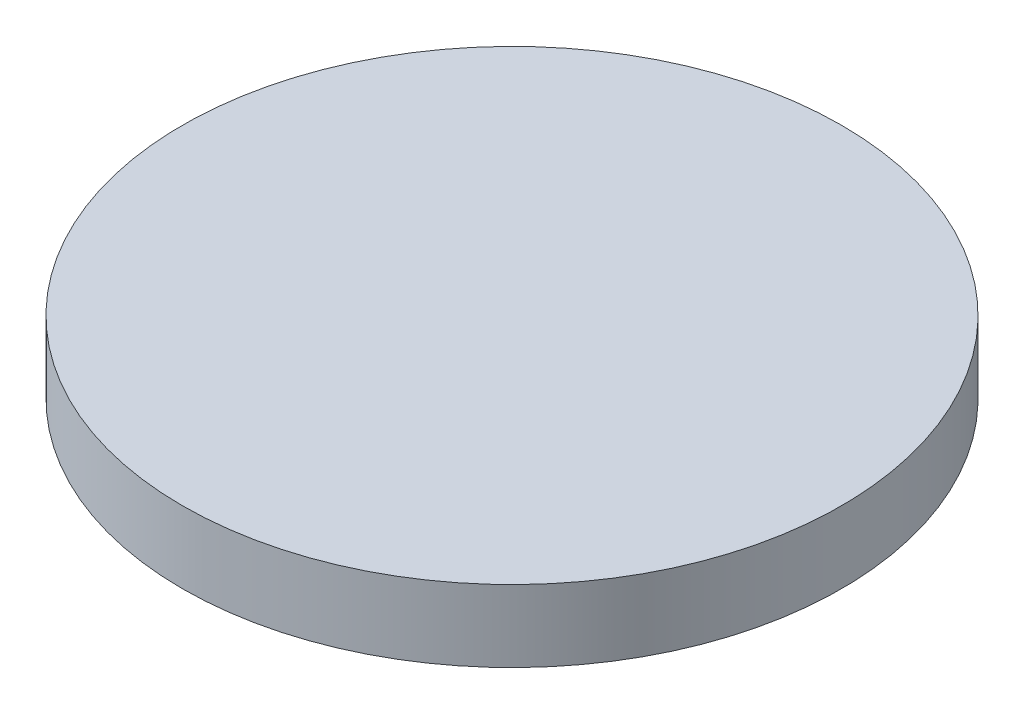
ISO-10303-21;
HEADER;
FILE_DESCRIPTION(('STEP AP214'),'2;1');
FILE_NAME('part.step','',(''),(''),'','','');
FILE_SCHEMA(('AUTOMOTIVE_DESIGN { 1 0 10303 214 1 1 1 1 }'));
ENDSEC;
DATA;
#1=APPLICATION_CONTEXT('core data for automotive mechanical design processes');
#2=APPLICATION_PROTOCOL_DEFINITION('international standard','automotive_design',2000,#1);
#3=PRODUCT_CONTEXT('',#1,'mechanical');
#4=PRODUCT('Part','Part','',(#3));
#5=PRODUCT_RELATED_PRODUCT_CATEGORY('part','',(#4));
#6=PRODUCT_DEFINITION_FORMATION('','',#4);
#7=PRODUCT_DEFINITION_CONTEXT('part definition',#1,'design');
#8=PRODUCT_DEFINITION('design','',#6,#7);
#9=PRODUCT_DEFINITION_SHAPE('','',#8);
#10=(LENGTH_UNIT() NAMED_UNIT(*) SI_UNIT(.MILLI.,.METRE.));
#11=(NAMED_UNIT(*) PLANE_ANGLE_UNIT() SI_UNIT($,.RADIAN.));
#12=(NAMED_UNIT(*) SI_UNIT($,.STERADIAN.) SOLID_ANGLE_UNIT());
#13=UNCERTAINTY_MEASURE_WITH_UNIT(LENGTH_MEASURE(1.E-05),#10,'distance_accuracy_value','');
#14=(GEOMETRIC_REPRESENTATION_CONTEXT(3) GLOBAL_UNCERTAINTY_ASSIGNED_CONTEXT((#13)) GLOBAL_UNIT_ASSIGNED_CONTEXT((#10,
#11,#12)) REPRESENTATION_CONTEXT('',''));
#15=CARTESIAN_POINT('',(0.,0.,0.));
#16=DIRECTION('',(0.,0.,1.));
#17=DIRECTION('',(1.,0.,0.));
#18=AXIS2_PLACEMENT_3D('',#15,#16,#17);
#19=CARTESIAN_POINT('',(0.,0.,0.));
#20=DIRECTION('',(0.,1.,0.));
#21=DIRECTION('',(0.,0.,1.));
#22=AXIS2_PLACEMENT_3D('',#19,#20,#21);
#23=PLANE('',#22);
#24=CARTESIAN_POINT('',(5.46099999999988,0.,9.45872946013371));
#25=DIRECTION('',(0.,-1.,0.));
#26=DIRECTION('',(-0.499999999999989,0.,-0.866025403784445));
#27=AXIS2_PLACEMENT_3D('',#24,#25,#26);
#28=CIRCLE('',#27,1.5875);
#29=CARTESIAN_POINT('',(4.6672499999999,0.,8.0839141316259));
#30=VERTEX_POINT('',#29);
#31=EDGE_CURVE('E120',#30,#30,#28,.T.);
#32=ORIENTED_EDGE('',*,*,#31,.F.);
#33=EDGE_LOOP('',(#32));
#34=FACE_BOUND('',#33,.T.);
#35=CARTESIAN_POINT('',(9.45872946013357,0.,5.46100000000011));
#36=DIRECTION('',(0.,-1.,0.));
#37=DIRECTION('',(-0.866025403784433,0.,-0.50000000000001));
#38=AXIS2_PLACEMENT_3D('',#35,#36,#37);
#39=CIRCLE('',#38,1.5875);
#40=CARTESIAN_POINT('',(8.08391413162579,0.,4.66725000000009));
#41=VERTEX_POINT('',#40);
#42=EDGE_CURVE('E114',#41,#41,#39,.T.);
#43=ORIENTED_EDGE('',*,*,#42,.F.);
#44=EDGE_LOOP('',(#43));
#45=FACE_BOUND('',#44,.T.);
#46=CARTESIAN_POINT('',(10.922,0.,1.14401877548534E-13));
#47=DIRECTION('',(0.,-1.,0.));
#48=DIRECTION('',(-1.,0.,0.));
#49=AXIS2_PLACEMENT_3D('',#46,#47,#48);
#50=CIRCLE('',#49,1.5875);
#51=CARTESIAN_POINT('',(9.3345,0.,0.));
#52=VERTEX_POINT('',#51);
#53=EDGE_CURVE('E108',#52,#52,#50,.T.);
#54=ORIENTED_EDGE('',*,*,#53,.F.);
#55=EDGE_LOOP('',(#54));
#56=FACE_BOUND('',#55,.T.);
#57=CARTESIAN_POINT('',(9.45872946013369,0.,-5.46099999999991));
#58=DIRECTION('',(0.,-1.,0.));
#59=DIRECTION('',(-0.866025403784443,0.,0.499999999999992));
#60=AXIS2_PLACEMENT_3D('',#57,#58,#59);
#61=CIRCLE('',#60,1.5875);
#62=CARTESIAN_POINT('',(8.08391413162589,0.,-4.66724999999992));
#63=VERTEX_POINT('',#62);
#64=EDGE_CURVE('E102',#63,#63,#61,.T.);
#65=ORIENTED_EDGE('',*,*,#64,.F.);
#66=EDGE_LOOP('',(#65));
#67=FACE_BOUND('',#66,.T.);
#68=CARTESIAN_POINT('',(5.46100000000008,0.,-9.45872946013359));
#69=DIRECTION('',(0.,-1.,0.));
#70=DIRECTION('',(-0.500000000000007,0.,0.866025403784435));
#71=AXIS2_PLACEMENT_3D('',#68,#69,#70);
#72=CIRCLE('',#71,1.5875);
#73=CARTESIAN_POINT('',(4.66725000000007,0.,-8.0839141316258));
#74=VERTEX_POINT('',#73);
#75=EDGE_CURVE('E96',#74,#74,#72,.T.);
#76=ORIENTED_EDGE('',*,*,#75,.F.);
#77=EDGE_LOOP('',(#76));
#78=FACE_BOUND('',#77,.T.);
#79=CARTESIAN_POINT('',(0.,0.,-10.922));
#80=DIRECTION('',(0.,-1.,0.));
#81=DIRECTION('',(0.,0.,1.));
#82=AXIS2_PLACEMENT_3D('',#79,#80,#81);
#83=CIRCLE('',#82,1.5875);
#84=CARTESIAN_POINT('',(0.,0.,-9.3345));
#85=VERTEX_POINT('',#84);
#86=EDGE_CURVE('E90',#85,#85,#83,.T.);
#87=ORIENTED_EDGE('',*,*,#86,.F.);
#88=EDGE_LOOP('',(#87));
#89=FACE_BOUND('',#88,.T.);
#90=CARTESIAN_POINT('',(-5.46099999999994,0.,-9.45872946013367));
#91=DIRECTION('',(0.,-1.,0.));
#92=DIRECTION('',(0.499999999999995,0.,0.866025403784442));
#93=AXIS2_PLACEMENT_3D('',#90,#91,#92);
#94=CIRCLE('',#93,1.5875);
#95=CARTESIAN_POINT('',(-4.66724999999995,0.,-8.08391413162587));
#96=VERTEX_POINT('',#95);
#97=EDGE_CURVE('E84',#96,#96,#94,.T.);
#98=ORIENTED_EDGE('',*,*,#97,.F.);
#99=EDGE_LOOP('',(#98));
#100=FACE_BOUND('',#99,.T.);
#101=CARTESIAN_POINT('',(-9.45872946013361,0.,-5.46100000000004));
#102=DIRECTION('',(0.,-1.,0.));
#103=DIRECTION('',(0.866025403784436,0.,0.500000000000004));
#104=AXIS2_PLACEMENT_3D('',#101,#102,#103);
#105=CIRCLE('',#104,1.5875);
#106=CARTESIAN_POINT('',(-8.08391413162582,0.,-4.66725000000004));
#107=VERTEX_POINT('',#106);
#108=EDGE_CURVE('E78',#107,#107,#105,.T.);
#109=ORIENTED_EDGE('',*,*,#108,.F.);
#110=EDGE_LOOP('',(#109));
#111=FACE_BOUND('',#110,.T.);
#112=CARTESIAN_POINT('',(-10.922,0.,0.));
#113=DIRECTION('',(0.,-1.,0.));
#114=DIRECTION('',(1.,0.,0.));
#115=AXIS2_PLACEMENT_3D('',#112,#113,#114);
#116=CIRCLE('',#115,1.5875);
#117=CARTESIAN_POINT('',(-9.3345,0.,0.));
#118=VERTEX_POINT('',#117);
#119=EDGE_CURVE('E72',#118,#118,#116,.T.);
#120=ORIENTED_EDGE('',*,*,#119,.F.);
#121=EDGE_LOOP('',(#120));
#122=FACE_BOUND('',#121,.T.);
#123=CARTESIAN_POINT('',(-9.45872946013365,0.,5.46099999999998));
#124=DIRECTION('',(0.,-1.,0.));
#125=DIRECTION('',(0.86602540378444,0.,-0.499999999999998));
#126=AXIS2_PLACEMENT_3D('',#123,#124,#125);
#127=CIRCLE('',#126,1.5875);
#128=CARTESIAN_POINT('',(-8.08391413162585,0.,4.66724999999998));
#129=VERTEX_POINT('',#128);
#130=EDGE_CURVE('E66',#129,#129,#127,.T.);
#131=ORIENTED_EDGE('',*,*,#130,.F.);
#132=EDGE_LOOP('',(#131));
#133=FACE_BOUND('',#132,.T.);
#134=CARTESIAN_POINT('',(-5.46100000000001,0.,9.45872946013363));
#135=DIRECTION('',(0.,-1.,0.));
#136=DIRECTION('',(0.500000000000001,0.,-0.866025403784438));
#137=AXIS2_PLACEMENT_3D('',#134,#135,#136);
#138=CIRCLE('',#137,1.5875);
#139=CARTESIAN_POINT('',(-4.66725000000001,0.,8.08391413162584));
#140=VERTEX_POINT('',#139);
#141=EDGE_CURVE('E60',#140,#140,#138,.T.);
#142=ORIENTED_EDGE('',*,*,#141,.F.);
#143=EDGE_LOOP('',(#142));
#144=FACE_BOUND('',#143,.T.);
#145=CARTESIAN_POINT('',(0.,0.,10.922));
#146=DIRECTION('',(0.,-1.,0.));
#147=DIRECTION('',(0.,0.,-1.));
#148=AXIS2_PLACEMENT_3D('',#145,#146,#147);
#149=CIRCLE('',#148,1.5875);
#150=CARTESIAN_POINT('',(0.,0.,9.3345));
#151=VERTEX_POINT('',#150);
#152=EDGE_CURVE('E54',#151,#151,#149,.T.);
#153=ORIENTED_EDGE('',*,*,#152,.F.);
#154=EDGE_LOOP('',(#153));
#155=FACE_BOUND('',#154,.T.);
#156=CARTESIAN_POINT('',(0.,0.,0.));
#157=DIRECTION('',(0.,1.,0.));
#158=DIRECTION('',(0.,0.,1.));
#159=AXIS2_PLACEMENT_3D('',#156,#157,#158);
#160=CIRCLE('',#159,13.97);
#161=CARTESIAN_POINT('',(0.,0.,-13.97));
#162=VERTEX_POINT('',#161);
#163=EDGE_CURVE('E44',#162,#162,#160,.T.);
#164=ORIENTED_EDGE('',*,*,#163,.F.);
#165=EDGE_LOOP('',(#164));
#166=FACE_BOUND('',#165,.T.);
#167=CARTESIAN_POINT('',(0.,0.,0.));
#168=DIRECTION('',(0.,1.,0.));
#169=DIRECTION('',(0.,0.,1.));
#170=AXIS2_PLACEMENT_3D('',#167,#168,#169);
#171=CIRCLE('',#170,8.001);
#172=CARTESIAN_POINT('',(0.,0.,8.001));
#173=VERTEX_POINT('',#172);
#174=EDGE_CURVE('E10',#173,#173,#171,.F.);
#175=ORIENTED_EDGE('',*,*,#174,.F.);
#176=EDGE_LOOP('',(#175));
#177=FACE_BOUND('',#176,.T.);
#178=ADVANCED_FACE('F33',(#34,#45,#56,#67,#78,#89,#100,#111,#122,#133,#144,#155,#166,#177),#23,.F.);
#179=CARTESIAN_POINT('',(0.,3.048,0.));
#180=DIRECTION('',(0.,-1.,0.));
#181=DIRECTION('',(0.,0.,-1.));
#182=AXIS2_PLACEMENT_3D('',#179,#180,#181);
#183=CYLINDRICAL_SURFACE('',#182,13.97);
#184=CARTESIAN_POINT('',(0.,3.048,0.));
#185=DIRECTION('',(0.,1.,0.));
#186=DIRECTION('',(0.,0.,1.));
#187=AXIS2_PLACEMENT_3D('',#184,#185,#186);
#188=CIRCLE('',#187,13.97);
#189=CARTESIAN_POINT('',(0.,3.048,-13.97));
#190=VERTEX_POINT('',#189);
#191=EDGE_CURVE('E40',#190,#190,#188,.T.);
#192=CARTESIAN_POINT('',(0.,3.048,-13.97));
#193=CARTESIAN_POINT('',(0.,3.01625,-13.97));
#194=CARTESIAN_POINT('',(0.,2.9845,-13.97));
#195=CARTESIAN_POINT('',(0.,2.921,-13.97));
#196=CARTESIAN_POINT('',(0.,2.88925,-13.97));
#197=CARTESIAN_POINT('',(0.,2.82575,-13.97));
#198=CARTESIAN_POINT('',(0.,2.794,-13.97));
#199=CARTESIAN_POINT('',(0.,2.7305,-13.97));
#200=CARTESIAN_POINT('',(0.,2.69875,-13.97));
#201=CARTESIAN_POINT('',(0.,2.63525,-13.97));
#202=CARTESIAN_POINT('',(0.,2.6035,-13.97));
#203=CARTESIAN_POINT('',(0.,2.54,-13.97));
#204=CARTESIAN_POINT('',(0.,2.50825,-13.97));
#205=CARTESIAN_POINT('',(0.,2.44475,-13.97));
#206=CARTESIAN_POINT('',(0.,2.413,-13.97));
#207=CARTESIAN_POINT('',(0.,2.3495,-13.97));
#208=CARTESIAN_POINT('',(0.,2.31775,-13.97));
#209=CARTESIAN_POINT('',(0.,2.25425,-13.97));
#210=CARTESIAN_POINT('',(0.,2.2225,-13.97));
#211=CARTESIAN_POINT('',(0.,2.159,-13.97));
#212=CARTESIAN_POINT('',(0.,2.12725,-13.97));
#213=CARTESIAN_POINT('',(0.,2.06375,-13.97));
#214=CARTESIAN_POINT('',(0.,2.032,-13.97));
#215=CARTESIAN_POINT('',(0.,1.9685,-13.97));
#216=CARTESIAN_POINT('',(0.,1.93675,-13.97));
#217=CARTESIAN_POINT('',(0.,1.87325,-13.97));
#218=CARTESIAN_POINT('',(0.,1.8415,-13.97));
#219=CARTESIAN_POINT('',(0.,1.778,-13.97));
#220=CARTESIAN_POINT('',(0.,1.74625,-13.97));
#221=CARTESIAN_POINT('',(0.,1.68275,-13.97));
#222=CARTESIAN_POINT('',(0.,1.651,-13.97));
#223=CARTESIAN_POINT('',(0.,1.5875,-13.97));
#224=CARTESIAN_POINT('',(0.,1.55575,-13.97));
#225=CARTESIAN_POINT('',(0.,1.49225,-13.97));
#226=CARTESIAN_POINT('',(0.,1.4605,-13.97));
#227=CARTESIAN_POINT('',(0.,1.397,-13.97));
#228=CARTESIAN_POINT('',(0.,1.36525,-13.97));
#229=CARTESIAN_POINT('',(0.,1.30175,-13.97));
#230=CARTESIAN_POINT('',(0.,1.27,-13.97));
#231=CARTESIAN_POINT('',(0.,1.2065,-13.97));
#232=CARTESIAN_POINT('',(0.,1.17475,-13.97));
#233=CARTESIAN_POINT('',(0.,1.11125,-13.97));
#234=CARTESIAN_POINT('',(0.,1.0795,-13.97));
#235=CARTESIAN_POINT('',(0.,1.016,-13.97));
#236=CARTESIAN_POINT('',(0.,0.98425,-13.97));
#237=CARTESIAN_POINT('',(0.,0.92075,-13.97));
#238=CARTESIAN_POINT('',(0.,0.889,-13.97));
#239=CARTESIAN_POINT('',(0.,0.8255,-13.97));
#240=CARTESIAN_POINT('',(0.,0.79375,-13.97));
#241=CARTESIAN_POINT('',(0.,0.73025,-13.97));
#242=CARTESIAN_POINT('',(0.,0.6985,-13.97));
#243=CARTESIAN_POINT('',(0.,0.635,-13.97));
#244=CARTESIAN_POINT('',(0.,0.60325,-13.97));
#245=CARTESIAN_POINT('',(0.,0.53975,-13.97));
#246=CARTESIAN_POINT('',(0.,0.508,-13.97));
#247=CARTESIAN_POINT('',(0.,0.4445,-13.97));
#248=CARTESIAN_POINT('',(0.,0.41275,-13.97));
#249=CARTESIAN_POINT('',(0.,0.34925,-13.97));
#250=CARTESIAN_POINT('',(0.,0.3175,-13.97));
#251=CARTESIAN_POINT('',(0.,0.254,-13.97));
#252=CARTESIAN_POINT('',(0.,0.22225,-13.97));
#253=CARTESIAN_POINT('',(0.,0.15875,-13.97));
#254=CARTESIAN_POINT('',(0.,0.127,-13.97));
#255=CARTESIAN_POINT('',(0.,0.0634999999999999,-13.97));
#256=CARTESIAN_POINT('',(0.,0.03175,-13.97));
#257=CARTESIAN_POINT('',(0.,0.,-13.97));
#258=B_SPLINE_CURVE_WITH_KNOTS('',3,(#192,#193,#194,#195,#196,#197,#198,#199,#200,#201,#202,
#203,#204,#205,#206,#207,#208,#209,#210,#211,#212,#213,#214,#215,#216,#217,#218,#219,#220,#221,
#222,#223,#224,#225,#226,#227,#228,#229,#230,#231,#232,#233,#234,#235,#236,#237,#238,#239,#240,
#241,#242,#243,#244,#245,#246,#247,#248,#249,#250,#251,#252,#253,#254,#255,#256,#257),
.UNSPECIFIED.,.F.,.F.,(4,2,2,2,2,2,2,2,2,2,2,2,2,2,2,2,2,2,2,2,2,2,2,2,2,2,2,2,2,2,2,2,4),(0.,
0.0952500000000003,0.1905,0.28575,0.381,0.47625,0.5715,0.66675,0.762,0.85725,0.9525,1.04775,
1.143,1.23825,1.3335,1.42875,1.524,1.61925,1.7145,1.80975,1.905,2.00025,2.0955,2.19075,2.286,
2.38125,2.4765,2.57175,2.667,2.76225,2.8575,2.95275,3.048),.UNSPECIFIED.);
#259=EDGE_CURVE('BSEAM35',#190,#162,#258,.T.);
#260=ORIENTED_EDGE('',*,*,#191,.F.);
#261=ORIENTED_EDGE('',*,*,#163,.T.);
#262=ORIENTED_EDGE('',*,*,#259,.T.);
#263=ORIENTED_EDGE('',*,*,#259,.F.);
#264=EDGE_LOOP('',(#260,#262,#261,#263));
#265=FACE_BOUND('',#264,.T.);
#266=ADVANCED_FACE('F35',(#265),#183,.T.);
#267=CARTESIAN_POINT('',(0.,3.048,0.));
#268=DIRECTION('',(0.,1.,0.));
#269=DIRECTION('',(0.,0.,1.));
#270=AXIS2_PLACEMENT_3D('',#267,#268,#269);
#271=PLANE('',#270);
#272=ORIENTED_EDGE('',*,*,#191,.T.);
#273=EDGE_LOOP('',(#272));
#274=FACE_BOUND('',#273,.T.);
#275=ADVANCED_FACE('F163',(#274),#271,.T.);
#276=CARTESIAN_POINT('',(0.,-1.778,0.));
#277=DIRECTION('',(0.,1.,0.));
#278=DIRECTION('',(0.,0.,1.));
#279=AXIS2_PLACEMENT_3D('',#276,#277,#278);
#280=CYLINDRICAL_SURFACE('',#279,8.001);
#281=CARTESIAN_POINT('',(0.,-1.778,0.));
#282=DIRECTION('',(0.,-1.,0.));
#283=DIRECTION('',(0.,0.,-1.));
#284=AXIS2_PLACEMENT_3D('',#281,#282,#283);
#285=CIRCLE('',#284,8.001);
#286=CARTESIAN_POINT('',(0.,-1.778,-8.001));
#287=VERTEX_POINT('',#286);
#288=EDGE_CURVE('E49',#287,#287,#285,.T.);
#289=ORIENTED_EDGE('',*,*,#288,.F.);
#290=EDGE_LOOP('',(#289));
#291=FACE_BOUND('',#290,.T.);
#292=ORIENTED_EDGE('',*,*,#174,.T.);
#293=EDGE_LOOP('',(#292));
#294=FACE_BOUND('',#293,.T.);
#295=ADVANCED_FACE('F168',(#291,#294),#280,.T.);
#296=CARTESIAN_POINT('',(0.,-1.778,0.));
#297=DIRECTION('',(0.,-1.,0.));
#298=DIRECTION('',(0.,0.,-1.));
#299=AXIS2_PLACEMENT_3D('',#296,#297,#298);
#300=PLANE('',#299);
#301=ORIENTED_EDGE('',*,*,#288,.T.);
#302=EDGE_LOOP('',(#301));
#303=FACE_BOUND('',#302,.T.);
#304=ADVANCED_FACE('F173',(#303),#300,.T.);
#305=CARTESIAN_POINT('',(0.,0.508,10.922));
#306=DIRECTION('',(0.,-1.,0.));
#307=DIRECTION('',(0.,0.,-1.));
#308=AXIS2_PLACEMENT_3D('',#305,#306,#307);
#309=CYLINDRICAL_SURFACE('',#308,1.5875);
#310=CARTESIAN_POINT('',(0.,0.508,10.922));
#311=DIRECTION('',(0.,-1.,0.));
#312=DIRECTION('',(0.,0.,-1.));
#313=AXIS2_PLACEMENT_3D('',#310,#311,#312);
#314=CIRCLE('',#313,1.5875);
#315=CARTESIAN_POINT('',(0.,0.508,9.3345));
#316=VERTEX_POINT('',#315);
#317=EDGE_CURVE('E53',#316,#316,#314,.T.);
#318=ORIENTED_EDGE('',*,*,#317,.F.);
#319=EDGE_LOOP('',(#318));
#320=FACE_BOUND('',#319,.T.);
#321=ORIENTED_EDGE('',*,*,#152,.T.);
#322=EDGE_LOOP('',(#321));
#323=FACE_BOUND('',#322,.T.);
#324=ADVANCED_FACE('F179',(#320,#323),#309,.F.);
#325=CARTESIAN_POINT('',(0.,0.508,10.922));
#326=DIRECTION('',(0.,-1.,0.));
#327=DIRECTION('',(0.,0.,-1.));
#328=AXIS2_PLACEMENT_3D('',#325,#326,#327);
#329=PLANE('',#328);
#330=ORIENTED_EDGE('',*,*,#317,.T.);
#331=EDGE_LOOP('',(#330));
#332=FACE_BOUND('',#331,.T.);
#333=ADVANCED_FACE('F183',(#332),#329,.T.);
#334=CARTESIAN_POINT('',(-5.46100000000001,0.508,9.45872946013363));
#335=DIRECTION('',(0.,-1.,0.));
#336=DIRECTION('',(0.,0.,-1.));
#337=AXIS2_PLACEMENT_3D('',#334,#335,#336);
#338=CYLINDRICAL_SURFACE('',#337,1.5875);
#339=CARTESIAN_POINT('',(-5.46100000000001,0.508,9.45872946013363));
#340=DIRECTION('',(0.,-1.,0.));
#341=DIRECTION('',(0.500000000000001,0.,-0.866025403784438));
#342=AXIS2_PLACEMENT_3D('',#339,#340,#341);
#343=CIRCLE('',#342,1.5875);
#344=CARTESIAN_POINT('',(-4.66725000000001,0.508,8.08391413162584));
#345=VERTEX_POINT('',#344);
#346=EDGE_CURVE('E57',#345,#345,#343,.T.);
#347=ORIENTED_EDGE('',*,*,#346,.F.);
#348=EDGE_LOOP('',(#347));
#349=FACE_BOUND('',#348,.T.);
#350=ORIENTED_EDGE('',*,*,#141,.T.);
#351=EDGE_LOOP('',(#350));
#352=FACE_BOUND('',#351,.T.);
#353=ADVANCED_FACE('F187',(#349,#352),#338,.F.);
#354=CARTESIAN_POINT('',(-5.46100000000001,0.508,9.45872946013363));
#355=DIRECTION('',(0.,-1.,0.));
#356=DIRECTION('',(0.500000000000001,0.,-0.866025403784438));
#357=AXIS2_PLACEMENT_3D('',#354,#355,#356);
#358=PLANE('',#357);
#359=ORIENTED_EDGE('',*,*,#346,.T.);
#360=EDGE_LOOP('',(#359));
#361=FACE_BOUND('',#360,.T.);
#362=ADVANCED_FACE('F191',(#361),#358,.T.);
#363=CARTESIAN_POINT('',(-9.45872946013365,0.508,5.46099999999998));
#364=DIRECTION('',(0.,-1.,0.));
#365=DIRECTION('',(0.,0.,-1.));
#366=AXIS2_PLACEMENT_3D('',#363,#364,#365);
#367=CYLINDRICAL_SURFACE('',#366,1.5875);
#368=CARTESIAN_POINT('',(-9.45872946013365,0.508,5.46099999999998));
#369=DIRECTION('',(0.,-1.,0.));
#370=DIRECTION('',(0.86602540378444,0.,-0.499999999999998));
#371=AXIS2_PLACEMENT_3D('',#368,#369,#370);
#372=CIRCLE('',#371,1.5875);
#373=CARTESIAN_POINT('',(-8.08391413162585,0.508,4.66724999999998));
#374=VERTEX_POINT('',#373);
#375=EDGE_CURVE('E63',#374,#374,#372,.T.);
#376=ORIENTED_EDGE('',*,*,#375,.F.);
#377=EDGE_LOOP('',(#376));
#378=FACE_BOUND('',#377,.T.);
#379=ORIENTED_EDGE('',*,*,#130,.T.);
#380=EDGE_LOOP('',(#379));
#381=FACE_BOUND('',#380,.T.);
#382=ADVANCED_FACE('F195',(#378,#381),#367,.F.);
#383=CARTESIAN_POINT('',(-9.45872946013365,0.508,5.46099999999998));
#384=DIRECTION('',(0.,-1.,0.));
#385=DIRECTION('',(0.86602540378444,0.,-0.499999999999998));
#386=AXIS2_PLACEMENT_3D('',#383,#384,#385);
#387=PLANE('',#386);
#388=ORIENTED_EDGE('',*,*,#375,.T.);
#389=EDGE_LOOP('',(#388));
#390=FACE_BOUND('',#389,.T.);
#391=ADVANCED_FACE('F199',(#390),#387,.T.);
#392=CARTESIAN_POINT('',(-10.922,0.508,0.));
#393=DIRECTION('',(0.,-1.,0.));
#394=DIRECTION('',(0.,0.,-1.));
#395=AXIS2_PLACEMENT_3D('',#392,#393,#394);
#396=CYLINDRICAL_SURFACE('',#395,1.5875);
#397=CARTESIAN_POINT('',(-10.922,0.508,0.));
#398=DIRECTION('',(0.,-1.,0.));
#399=DIRECTION('',(1.,0.,0.));
#400=AXIS2_PLACEMENT_3D('',#397,#398,#399);
#401=CIRCLE('',#400,1.5875);
#402=CARTESIAN_POINT('',(-9.3345,0.508,0.));
#403=VERTEX_POINT('',#402);
#404=EDGE_CURVE('E69',#403,#403,#401,.T.);
#405=ORIENTED_EDGE('',*,*,#404,.F.);
#406=EDGE_LOOP('',(#405));
#407=FACE_BOUND('',#406,.T.);
#408=ORIENTED_EDGE('',*,*,#119,.T.);
#409=EDGE_LOOP('',(#408));
#410=FACE_BOUND('',#409,.T.);
#411=ADVANCED_FACE('F203',(#407,#410),#396,.F.);
#412=CARTESIAN_POINT('',(-10.922,0.508,0.));
#413=DIRECTION('',(0.,-1.,0.));
#414=DIRECTION('',(1.,0.,0.));
#415=AXIS2_PLACEMENT_3D('',#412,#413,#414);
#416=PLANE('',#415);
#417=ORIENTED_EDGE('',*,*,#404,.T.);
#418=EDGE_LOOP('',(#417));
#419=FACE_BOUND('',#418,.T.);
#420=ADVANCED_FACE('F207',(#419),#416,.T.);
#421=CARTESIAN_POINT('',(-9.45872946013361,0.508,-5.46100000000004));
#422=DIRECTION('',(0.,-1.,0.));
#423=DIRECTION('',(0.,0.,-1.));
#424=AXIS2_PLACEMENT_3D('',#421,#422,#423);
#425=CYLINDRICAL_SURFACE('',#424,1.5875);
#426=CARTESIAN_POINT('',(-9.45872946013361,0.508,-5.46100000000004));
#427=DIRECTION('',(0.,-1.,0.));
#428=DIRECTION('',(0.866025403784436,0.,0.500000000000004));
#429=AXIS2_PLACEMENT_3D('',#426,#427,#428);
#430=CIRCLE('',#429,1.5875);
#431=CARTESIAN_POINT('',(-8.08391413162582,0.508,-4.66725000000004));
#432=VERTEX_POINT('',#431);
#433=EDGE_CURVE('E75',#432,#432,#430,.T.);
#434=ORIENTED_EDGE('',*,*,#433,.F.);
#435=EDGE_LOOP('',(#434));
#436=FACE_BOUND('',#435,.T.);
#437=ORIENTED_EDGE('',*,*,#108,.T.);
#438=EDGE_LOOP('',(#437));
#439=FACE_BOUND('',#438,.T.);
#440=ADVANCED_FACE('F211',(#436,#439),#425,.F.);
#441=CARTESIAN_POINT('',(-9.45872946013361,0.508,-5.46100000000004));
#442=DIRECTION('',(0.,-1.,0.));
#443=DIRECTION('',(0.866025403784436,0.,0.500000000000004));
#444=AXIS2_PLACEMENT_3D('',#441,#442,#443);
#445=PLANE('',#444);
#446=ORIENTED_EDGE('',*,*,#433,.T.);
#447=EDGE_LOOP('',(#446));
#448=FACE_BOUND('',#447,.T.);
#449=ADVANCED_FACE('F215',(#448),#445,.T.);
#450=CARTESIAN_POINT('',(-5.46099999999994,0.508,-9.45872946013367));
#451=DIRECTION('',(0.,-1.,0.));
#452=DIRECTION('',(0.,0.,-1.));
#453=AXIS2_PLACEMENT_3D('',#450,#451,#452);
#454=CYLINDRICAL_SURFACE('',#453,1.5875);
#455=CARTESIAN_POINT('',(-5.46099999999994,0.508,-9.45872946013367));
#456=DIRECTION('',(0.,-1.,0.));
#457=DIRECTION('',(0.499999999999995,0.,0.866025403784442));
#458=AXIS2_PLACEMENT_3D('',#455,#456,#457);
#459=CIRCLE('',#458,1.5875);
#460=CARTESIAN_POINT('',(-4.66724999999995,0.508,-8.08391413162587));
#461=VERTEX_POINT('',#460);
#462=EDGE_CURVE('E81',#461,#461,#459,.T.);
#463=ORIENTED_EDGE('',*,*,#462,.F.);
#464=EDGE_LOOP('',(#463));
#465=FACE_BOUND('',#464,.T.);
#466=ORIENTED_EDGE('',*,*,#97,.T.);
#467=EDGE_LOOP('',(#466));
#468=FACE_BOUND('',#467,.T.);
#469=ADVANCED_FACE('F219',(#465,#468),#454,.F.);
#470=CARTESIAN_POINT('',(-5.46099999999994,0.508,-9.45872946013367));
#471=DIRECTION('',(0.,-1.,0.));
#472=DIRECTION('',(0.499999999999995,0.,0.866025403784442));
#473=AXIS2_PLACEMENT_3D('',#470,#471,#472);
#474=PLANE('',#473);
#475=ORIENTED_EDGE('',*,*,#462,.T.);
#476=EDGE_LOOP('',(#475));
#477=FACE_BOUND('',#476,.T.);
#478=ADVANCED_FACE('F223',(#477),#474,.T.);
#479=CARTESIAN_POINT('',(0.,0.508,-10.922));
#480=DIRECTION('',(0.,-1.,0.));
#481=DIRECTION('',(0.,0.,-1.));
#482=AXIS2_PLACEMENT_3D('',#479,#480,#481);
#483=CYLINDRICAL_SURFACE('',#482,1.5875);
#484=CARTESIAN_POINT('',(0.,0.508,-10.922));
#485=DIRECTION('',(0.,-1.,0.));
#486=DIRECTION('',(0.,0.,1.));
#487=AXIS2_PLACEMENT_3D('',#484,#485,#486);
#488=CIRCLE('',#487,1.5875);
#489=CARTESIAN_POINT('',(0.,0.508,-9.3345));
#490=VERTEX_POINT('',#489);
#491=EDGE_CURVE('E87',#490,#490,#488,.T.);
#492=ORIENTED_EDGE('',*,*,#491,.F.);
#493=EDGE_LOOP('',(#492));
#494=FACE_BOUND('',#493,.T.);
#495=ORIENTED_EDGE('',*,*,#86,.T.);
#496=EDGE_LOOP('',(#495));
#497=FACE_BOUND('',#496,.T.);
#498=ADVANCED_FACE('F227',(#494,#497),#483,.F.);
#499=CARTESIAN_POINT('',(0.,0.508,-10.922));
#500=DIRECTION('',(0.,-1.,0.));
#501=DIRECTION('',(0.,0.,1.));
#502=AXIS2_PLACEMENT_3D('',#499,#500,#501);
#503=PLANE('',#502);
#504=ORIENTED_EDGE('',*,*,#491,.T.);
#505=EDGE_LOOP('',(#504));
#506=FACE_BOUND('',#505,.T.);
#507=ADVANCED_FACE('F231',(#506),#503,.T.);
#508=CARTESIAN_POINT('',(5.46100000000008,0.508,-9.45872946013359));
#509=DIRECTION('',(0.,-1.,0.));
#510=DIRECTION('',(0.,0.,-1.));
#511=AXIS2_PLACEMENT_3D('',#508,#509,#510);
#512=CYLINDRICAL_SURFACE('',#511,1.5875);
#513=CARTESIAN_POINT('',(5.46100000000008,0.508,-9.45872946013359));
#514=DIRECTION('',(0.,-1.,0.));
#515=DIRECTION('',(-0.500000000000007,0.,0.866025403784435));
#516=AXIS2_PLACEMENT_3D('',#513,#514,#515);
#517=CIRCLE('',#516,1.5875);
#518=CARTESIAN_POINT('',(4.66725000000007,0.508,-8.0839141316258));
#519=VERTEX_POINT('',#518);
#520=EDGE_CURVE('E93',#519,#519,#517,.T.);
#521=ORIENTED_EDGE('',*,*,#520,.F.);
#522=EDGE_LOOP('',(#521));
#523=FACE_BOUND('',#522,.T.);
#524=ORIENTED_EDGE('',*,*,#75,.T.);
#525=EDGE_LOOP('',(#524));
#526=FACE_BOUND('',#525,.T.);
#527=ADVANCED_FACE('F235',(#523,#526),#512,.F.);
#528=CARTESIAN_POINT('',(5.46100000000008,0.508,-9.45872946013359));
#529=DIRECTION('',(0.,-1.,0.));
#530=DIRECTION('',(-0.500000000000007,0.,0.866025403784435));
#531=AXIS2_PLACEMENT_3D('',#528,#529,#530);
#532=PLANE('',#531);
#533=ORIENTED_EDGE('',*,*,#520,.T.);
#534=EDGE_LOOP('',(#533));
#535=FACE_BOUND('',#534,.T.);
#536=ADVANCED_FACE('F239',(#535),#532,.T.);
#537=CARTESIAN_POINT('',(9.45872946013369,0.508,-5.46099999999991));
#538=DIRECTION('',(0.,-1.,0.));
#539=DIRECTION('',(0.,0.,-1.));
#540=AXIS2_PLACEMENT_3D('',#537,#538,#539);
#541=CYLINDRICAL_SURFACE('',#540,1.5875);
#542=CARTESIAN_POINT('',(9.45872946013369,0.508,-5.46099999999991));
#543=DIRECTION('',(0.,-1.,0.));
#544=DIRECTION('',(-0.866025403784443,0.,0.499999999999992));
#545=AXIS2_PLACEMENT_3D('',#542,#543,#544);
#546=CIRCLE('',#545,1.5875);
#547=CARTESIAN_POINT('',(8.08391413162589,0.508,-4.66724999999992));
#548=VERTEX_POINT('',#547);
#549=EDGE_CURVE('E99',#548,#548,#546,.T.);
#550=ORIENTED_EDGE('',*,*,#549,.F.);
#551=EDGE_LOOP('',(#550));
#552=FACE_BOUND('',#551,.T.);
#553=ORIENTED_EDGE('',*,*,#64,.T.);
#554=EDGE_LOOP('',(#553));
#555=FACE_BOUND('',#554,.T.);
#556=ADVANCED_FACE('F243',(#552,#555),#541,.F.);
#557=CARTESIAN_POINT('',(9.45872946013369,0.508,-5.46099999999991));
#558=DIRECTION('',(0.,-1.,0.));
#559=DIRECTION('',(-0.866025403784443,0.,0.499999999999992));
#560=AXIS2_PLACEMENT_3D('',#557,#558,#559);
#561=PLANE('',#560);
#562=ORIENTED_EDGE('',*,*,#549,.T.);
#563=EDGE_LOOP('',(#562));
#564=FACE_BOUND('',#563,.T.);
#565=ADVANCED_FACE('F247',(#564),#561,.T.);
#566=CARTESIAN_POINT('',(10.922,0.508,1.14401877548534E-13));
#567=DIRECTION('',(0.,-1.,0.));
#568=DIRECTION('',(0.,0.,-1.));
#569=AXIS2_PLACEMENT_3D('',#566,#567,#568);
#570=CYLINDRICAL_SURFACE('',#569,1.5875);
#571=CARTESIAN_POINT('',(10.922,0.508,1.14401877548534E-13));
#572=DIRECTION('',(0.,-1.,0.));
#573=DIRECTION('',(-1.,0.,0.));
#574=AXIS2_PLACEMENT_3D('',#571,#572,#573);
#575=CIRCLE('',#574,1.5875);
#576=CARTESIAN_POINT('',(9.3345,0.508,0.));
#577=VERTEX_POINT('',#576);
#578=EDGE_CURVE('E105',#577,#577,#575,.T.);
#579=ORIENTED_EDGE('',*,*,#578,.F.);
#580=EDGE_LOOP('',(#579));
#581=FACE_BOUND('',#580,.T.);
#582=ORIENTED_EDGE('',*,*,#53,.T.);
#583=EDGE_LOOP('',(#582));
#584=FACE_BOUND('',#583,.T.);
#585=ADVANCED_FACE('F251',(#581,#584),#570,.F.);
#586=CARTESIAN_POINT('',(10.922,0.508,1.14401877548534E-13));
#587=DIRECTION('',(0.,-1.,0.));
#588=DIRECTION('',(-1.,0.,0.));
#589=AXIS2_PLACEMENT_3D('',#586,#587,#588);
#590=PLANE('',#589);
#591=ORIENTED_EDGE('',*,*,#578,.T.);
#592=EDGE_LOOP('',(#591));
#593=FACE_BOUND('',#592,.T.);
#594=ADVANCED_FACE('F255',(#593),#590,.T.);
#595=CARTESIAN_POINT('',(9.45872946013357,0.508,5.46100000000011));
#596=DIRECTION('',(0.,-1.,0.));
#597=DIRECTION('',(0.,0.,-1.));
#598=AXIS2_PLACEMENT_3D('',#595,#596,#597);
#599=CYLINDRICAL_SURFACE('',#598,1.5875);
#600=CARTESIAN_POINT('',(9.45872946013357,0.508,5.46100000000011));
#601=DIRECTION('',(0.,-1.,0.));
#602=DIRECTION('',(-0.866025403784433,0.,-0.50000000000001));
#603=AXIS2_PLACEMENT_3D('',#600,#601,#602);
#604=CIRCLE('',#603,1.5875);
#605=CARTESIAN_POINT('',(8.08391413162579,0.508,4.66725000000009));
#606=VERTEX_POINT('',#605);
#607=EDGE_CURVE('E111',#606,#606,#604,.T.);
#608=ORIENTED_EDGE('',*,*,#607,.F.);
#609=EDGE_LOOP('',(#608));
#610=FACE_BOUND('',#609,.T.);
#611=ORIENTED_EDGE('',*,*,#42,.T.);
#612=EDGE_LOOP('',(#611));
#613=FACE_BOUND('',#612,.T.);
#614=ADVANCED_FACE('F259',(#610,#613),#599,.F.);
#615=CARTESIAN_POINT('',(9.45872946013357,0.508,5.46100000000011));
#616=DIRECTION('',(0.,-1.,0.));
#617=DIRECTION('',(-0.866025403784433,0.,-0.50000000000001));
#618=AXIS2_PLACEMENT_3D('',#615,#616,#617);
#619=PLANE('',#618);
#620=ORIENTED_EDGE('',*,*,#607,.T.);
#621=EDGE_LOOP('',(#620));
#622=FACE_BOUND('',#621,.T.);
#623=ADVANCED_FACE('F131',(#622),#619,.T.);
#624=CARTESIAN_POINT('',(5.46099999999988,0.508,9.45872946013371));
#625=DIRECTION('',(0.,-1.,0.));
#626=DIRECTION('',(0.,0.,-1.));
#627=AXIS2_PLACEMENT_3D('',#624,#625,#626);
#628=CYLINDRICAL_SURFACE('',#627,1.5875);
#629=CARTESIAN_POINT('',(5.46099999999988,0.508,9.45872946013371));
#630=DIRECTION('',(0.,-1.,0.));
#631=DIRECTION('',(-0.499999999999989,0.,-0.866025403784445));
#632=AXIS2_PLACEMENT_3D('',#629,#630,#631);
#633=CIRCLE('',#632,1.5875);
#634=CARTESIAN_POINT('',(4.6672499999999,0.508,8.0839141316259));
#635=VERTEX_POINT('',#634);
#636=EDGE_CURVE('E117',#635,#635,#633,.T.);
#637=ORIENTED_EDGE('',*,*,#636,.F.);
#638=EDGE_LOOP('',(#637));
#639=FACE_BOUND('',#638,.T.);
#640=ORIENTED_EDGE('',*,*,#31,.T.);
#641=EDGE_LOOP('',(#640));
#642=FACE_BOUND('',#641,.T.);
#643=ADVANCED_FACE('F128',(#639,#642),#628,.F.);
#644=CARTESIAN_POINT('',(5.46099999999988,0.508,9.45872946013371));
#645=DIRECTION('',(0.,-1.,0.));
#646=DIRECTION('',(-0.499999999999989,0.,-0.866025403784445));
#647=AXIS2_PLACEMENT_3D('',#644,#645,#646);
#648=PLANE('',#647);
#649=ORIENTED_EDGE('',*,*,#636,.T.);
#650=EDGE_LOOP('',(#649));
#651=FACE_BOUND('',#650,.T.);
#652=ADVANCED_FACE('F126',(#651),#648,.T.);
#653=CLOSED_SHELL('',(#178,#266,#275,#295,#304,#324,#333,#353,#362,#382,#391,#411,#420,#440,
#449,#469,#478,#498,#507,#527,#536,#556,#565,#585,#594,#614,#623,#643,#652));
#654=MANIFOLD_SOLID_BREP('B2',#653);
#655=ADVANCED_BREP_SHAPE_REPRESENTATION('',(#18,#654),#14);
#656=SHAPE_DEFINITION_REPRESENTATION(#9,#655);
ENDSEC;
END-ISO-10303-21;
